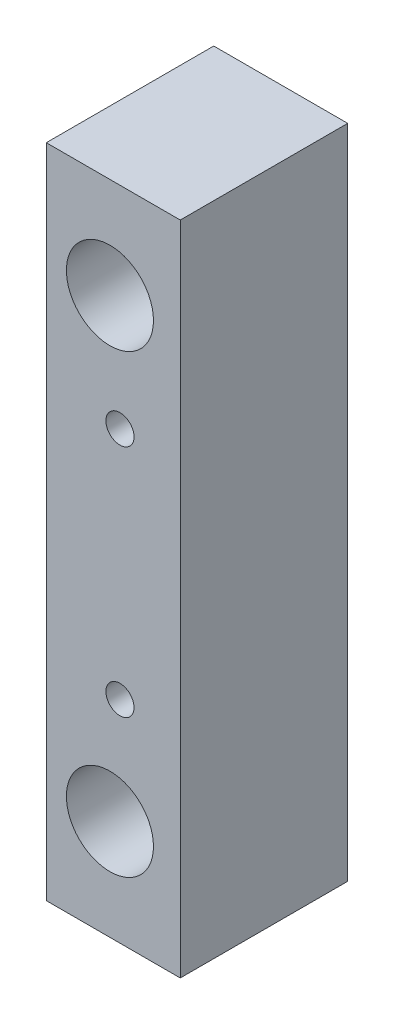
from build123d import *

# Parameters (mm, degrees)
ESQUISSE1_W             = 40
ESQUISSE1_H             = 196
EXTRUSION1_DEPTH        = 50
D_GAGEMENT_M81_D        = 8.4
ESQUISSE6_R             = 13
ENL_V_MAT_EXTRU_1_DEPTH = 207.194083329


with BuildPart() as part:
    # Esquisse1 → Extrusion1 (new body)
    with BuildSketch(Plane.XY):
        with Locations((20, 98)):
            Rectangle(ESQUISSE1_W, ESQUISSE1_H)
    extrude(amount=EXTRUSION1_DEPTH)

    # D_gagement M81 (through all)
    with Locations(Plane.XY.offset(50)):
        with Locations((22, 133), (22, 63)):
            Hole(D_GAGEMENT_M81_D / 2)

    # Esquisse6 → Enl_v. mat.-Extru.1 (cut, through all)
    with BuildSketch(Plane.XY.offset(50)):
        with Locations((19, 166)):
            Circle(ESQUISSE6_R)
        with Locations((19, 30)):
            Circle(ESQUISSE6_R)
    extrude(amount=-ENL_V_MAT_EXTRU_1_DEPTH, mode=Mode.SUBTRACT)


solid = part.part
